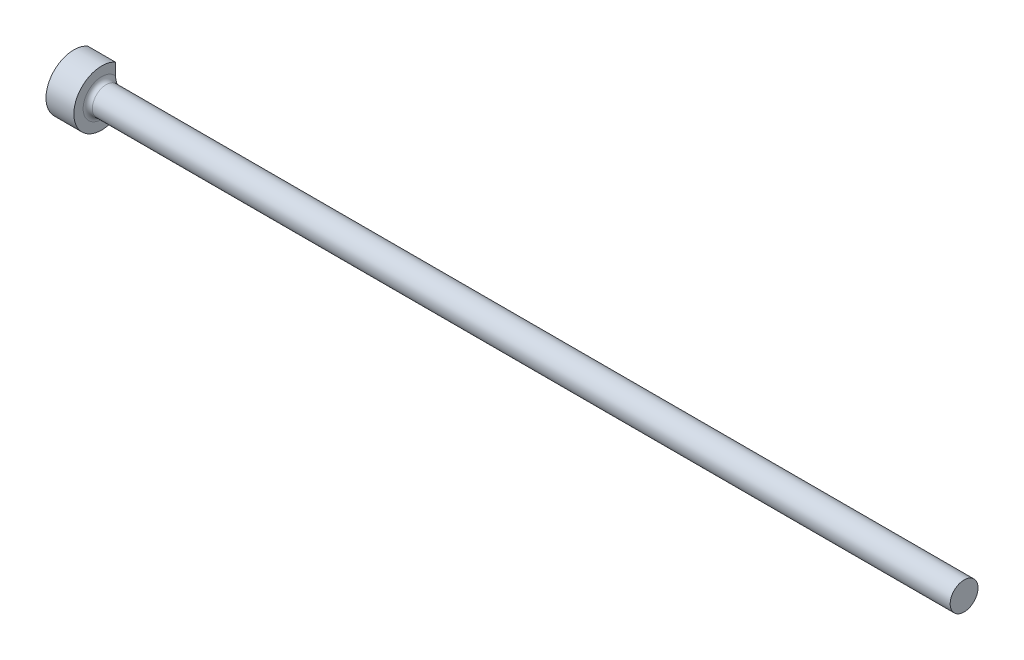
ISO-10303-21;
HEADER;
FILE_DESCRIPTION(('STEP AP214'),'2;1');
FILE_NAME('part.step','',(''),(''),'','','');
FILE_SCHEMA(('AUTOMOTIVE_DESIGN { 1 0 10303 214 1 1 1 1 }'));
ENDSEC;
DATA;
#1=APPLICATION_CONTEXT('core data for automotive mechanical design processes');
#2=APPLICATION_PROTOCOL_DEFINITION('international standard','automotive_design',2000,#1);
#3=PRODUCT_CONTEXT('',#1,'mechanical');
#4=PRODUCT('Part','Part','',(#3));
#5=PRODUCT_RELATED_PRODUCT_CATEGORY('part','',(#4));
#6=PRODUCT_DEFINITION_FORMATION('','',#4);
#7=PRODUCT_DEFINITION_CONTEXT('part definition',#1,'design');
#8=PRODUCT_DEFINITION('design','',#6,#7);
#9=PRODUCT_DEFINITION_SHAPE('','',#8);
#10=(LENGTH_UNIT() NAMED_UNIT(*) SI_UNIT(.MILLI.,.METRE.));
#11=(NAMED_UNIT(*) PLANE_ANGLE_UNIT() SI_UNIT($,.RADIAN.));
#12=(NAMED_UNIT(*) SI_UNIT($,.STERADIAN.) SOLID_ANGLE_UNIT());
#13=UNCERTAINTY_MEASURE_WITH_UNIT(LENGTH_MEASURE(1.E-05),#10,'distance_accuracy_value','');
#14=(GEOMETRIC_REPRESENTATION_CONTEXT(3) GLOBAL_UNCERTAINTY_ASSIGNED_CONTEXT((#13)) GLOBAL_UNIT_ASSIGNED_CONTEXT((#10,
#11,#12)) REPRESENTATION_CONTEXT('',''));
#15=CARTESIAN_POINT('',(0.,0.,0.));
#16=DIRECTION('',(0.,0.,1.));
#17=DIRECTION('',(1.,0.,0.));
#18=AXIS2_PLACEMENT_3D('',#15,#16,#17);
#19=CARTESIAN_POINT('',(0.,0.,0.));
#20=DIRECTION('',(1.,0.,0.));
#21=DIRECTION('',(0.,1.,0.));
#22=AXIS2_PLACEMENT_3D('',#19,#20,#21);
#23=PLANE('',#22);
#24=DIRECTION('',(0.,1.,0.));
#25=VECTOR('',#24,1.);
#26=CARTESIAN_POINT('',(0.,0.,-2.38150400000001));
#27=LINE('',#26,#25);
#28=CARTESIAN_POINT('',(0.,-4.12429932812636,-2.38150400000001));
#29=VERTEX_POINT('',#28);
#30=CARTESIAN_POINT('',(0.,4.12429932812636,-2.38150400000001));
#31=VERTEX_POINT('',#30);
#32=EDGE_CURVE('E49',#29,#31,#27,.T.);
#33=ORIENTED_EDGE('',*,*,#32,.F.);
#34=CARTESIAN_POINT('',(0.,0.,0.));
#35=DIRECTION('',(-1.,0.,0.));
#36=DIRECTION('',(0.,-1.,0.));
#37=AXIS2_PLACEMENT_3D('',#34,#35,#36);
#38=CIRCLE('',#37,4.76249999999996);
#39=EDGE_CURVE('E43',#29,#31,#38,.T.);
#40=ORIENTED_EDGE('',*,*,#39,.T.);
#41=EDGE_LOOP('',(#33,#40));
#42=FACE_BOUND('',#41,.T.);
#43=ADVANCED_FACE('F32',(#42),#23,.F.);
#44=CARTESIAN_POINT('',(152.4,0.,0.));
#45=DIRECTION('',(-1.,0.,0.));
#46=DIRECTION('',(0.,-1.,0.));
#47=AXIS2_PLACEMENT_3D('',#44,#45,#46);
#48=CYLINDRICAL_SURFACE('',#47,4.76249999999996);
#49=DIRECTION('',(-1.,0.,0.));
#50=VECTOR('',#49,1.);
#51=CARTESIAN_POINT('',(152.4,-4.12429932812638,-2.38150400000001));
#52=LINE('',#51,#50);
#53=CARTESIAN_POINT('',(4.7625,-4.12429932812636,-2.38150400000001));
#54=VERTEX_POINT('',#53);
#55=EDGE_CURVE('E87',#54,#29,#52,.T.);
#56=ORIENTED_EDGE('',*,*,#55,.F.);
#57=CARTESIAN_POINT('',(4.7625,0.,0.));
#58=DIRECTION('',(-1.,0.,0.));
#59=DIRECTION('',(0.,-1.,0.));
#60=AXIS2_PLACEMENT_3D('',#57,#58,#59);
#61=CIRCLE('',#60,4.76249999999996);
#62=CARTESIAN_POINT('',(4.7625,4.12429932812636,-2.38150400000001));
#63=VERTEX_POINT('',#62);
#64=EDGE_CURVE('E75',#54,#63,#61,.T.);
#65=ORIENTED_EDGE('',*,*,#64,.T.);
#66=DIRECTION('',(-1.,0.,0.));
#67=VECTOR('',#66,1.);
#68=CARTESIAN_POINT('',(152.4,4.12429932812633,-2.38150400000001));
#69=LINE('',#68,#67);
#70=EDGE_CURVE('E56',#31,#63,#69,.F.);
#71=ORIENTED_EDGE('',*,*,#70,.F.);
#72=ORIENTED_EDGE('',*,*,#39,.F.);
#73=EDGE_LOOP('',(#56,#65,#71,#72));
#74=FACE_BOUND('',#73,.T.);
#75=ADVANCED_FACE('F97',(#74),#48,.T.);
#76=CARTESIAN_POINT('',(4.7625,4.76249999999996,0.));
#77=DIRECTION('',(-1.,0.,0.));
#78=DIRECTION('',(0.,-1.,0.));
#79=AXIS2_PLACEMENT_3D('',#76,#77,#78);
#80=PLANE('',#79);
#81=DIRECTION('',(0.,-1.,0.));
#82=VECTOR('',#81,1.);
#83=CARTESIAN_POINT('',(4.7625,4.76249999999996,-2.38150400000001));
#84=LINE('',#83,#82);
#85=CARTESIAN_POINT('',(4.7625,2.09016303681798,-2.38150400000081));
#86=VERTEX_POINT('',#85);
#87=EDGE_CURVE('E84',#63,#86,#84,.T.);
#88=ORIENTED_EDGE('',*,*,#87,.F.);
#89=ORIENTED_EDGE('',*,*,#64,.F.);
#90=CARTESIAN_POINT('',(4.7625,-2.09016303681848,-2.38150400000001));
#91=VERTEX_POINT('',#90);
#92=EDGE_CURVE('E80',#91,#54,#84,.T.);
#93=ORIENTED_EDGE('',*,*,#92,.F.);
#94=CARTESIAN_POINT('',(4.7625,0.,0.));
#95=DIRECTION('',(-1.,0.,0.));
#96=DIRECTION('',(0.,-1.,0.));
#97=AXIS2_PLACEMENT_3D('',#94,#95,#96);
#98=CIRCLE('',#97,3.16865);
#99=EDGE_CURVE('E70',#91,#86,#98,.T.);
#100=ORIENTED_EDGE('',*,*,#99,.T.);
#101=EDGE_LOOP('',(#88,#89,#93,#100));
#102=FACE_BOUND('',#101,.T.);
#103=ADVANCED_FACE('F81',(#102),#80,.F.);
#104=CARTESIAN_POINT('',(5.5499,0.,0.));
#105=DIRECTION('',(-1.,0.,0.));
#106=DIRECTION('',(0.,-1.,0.));
#107=AXIS2_PLACEMENT_3D('',#104,#105,#106);
#108=TOROIDAL_SURFACE('',#107,3.16865,0.787399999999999);
#109=CARTESIAN_POINT('',(5.5499,0.,0.));
#110=DIRECTION('',(-1.,0.,0.));
#111=DIRECTION('',(0.,-1.,0.));
#112=AXIS2_PLACEMENT_3D('',#109,#110,#111);
#113=CIRCLE('',#112,2.38125);
#114=CARTESIAN_POINT('',(5.5499,-2.38125,0.));
#115=VERTEX_POINT('',#114);
#116=EDGE_CURVE('E76',#115,#115,#113,.T.);
#117=ORIENTED_EDGE('',*,*,#116,.T.);
#118=EDGE_LOOP('',(#117));
#119=FACE_BOUND('',#118,.T.);
#120=CARTESIAN_POINT('',(5.52990163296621,0.,-2.38150400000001));
#121=CARTESIAN_POINT('',(5.52989322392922,-0.00612063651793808,-2.38150400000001));
#122=CARTESIAN_POINT('',(5.52890240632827,-0.0122427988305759,-2.38150400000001));
#123=CARTESIAN_POINT('',(5.52573986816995,-0.0242237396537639,-2.38150400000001));
#124=CARTESIAN_POINT('',(5.52354525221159,-0.0300749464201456,-2.38150400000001));
#125=CARTESIAN_POINT('',(5.51205911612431,-0.0581616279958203,-2.38150400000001));
#126=CARTESIAN_POINT('',(5.50043530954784,-0.0793524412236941,-2.38150400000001));
#127=CARTESIAN_POINT('',(5.47727250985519,-0.121477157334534,-2.38150400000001));
#128=CARTESIAN_POINT('',(5.46573351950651,-0.142411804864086,-2.38150400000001));
#129=CARTESIAN_POINT('',(5.43096697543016,-0.204982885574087,-2.38150400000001));
#130=CARTESIAN_POINT('',(5.40751653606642,-0.246522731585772,-2.38150400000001));
#131=CARTESIAN_POINT('',(5.3609622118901,-0.3297912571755,-2.38150400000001));
#132=CARTESIAN_POINT('',(5.33785842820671,-0.371519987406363,-2.38150400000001));
#133=CARTESIAN_POINT('',(5.29197775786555,-0.455417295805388,-2.38150400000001));
#134=CARTESIAN_POINT('',(5.26920287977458,-0.497587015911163,-2.38150400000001));
#135=CARTESIAN_POINT('',(5.22431538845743,-0.582264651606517,-2.38150400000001));
#136=CARTESIAN_POINT('',(5.2022027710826,-0.624772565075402,-2.38150400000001));
#137=CARTESIAN_POINT('',(5.09259709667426,-0.840505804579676,-2.38150400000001));
#138=CARTESIAN_POINT('',(5.01126780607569,-1.01722711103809,-2.38150400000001));
#139=CARTESIAN_POINT('',(4.90984993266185,-1.28951258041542,-2.38150400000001));
#140=CARTESIAN_POINT('',(4.87952695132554,-1.38122131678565,-2.38150400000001));
#141=CARTESIAN_POINT('',(4.82784510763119,-1.56709229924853,-2.38150400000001));
#142=CARTESIAN_POINT('',(4.80647377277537,-1.66125093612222,-2.38150400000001));
#143=CARTESIAN_POINT('',(4.77935745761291,-1.82676032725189,-2.38150400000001));
#144=CARTESIAN_POINT('',(4.77099421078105,-1.89767533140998,-2.38150400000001));
#145=CARTESIAN_POINT('',(4.76188007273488,-2.04013238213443,-2.38150400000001));
#146=CARTESIAN_POINT('',(4.76113842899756,-2.11167508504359,-2.38150400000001));
#147=CARTESIAN_POINT('',(4.76877745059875,-2.25484218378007,-2.38150400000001));
#148=CARTESIAN_POINT('',(4.77722304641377,-2.32646354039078,-2.38150400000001));
#149=CARTESIAN_POINT('',(4.80498534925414,-2.46760262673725,-2.38150400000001));
#150=CARTESIAN_POINT('',(4.82428631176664,-2.53712324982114,-2.38150400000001));
#151=CARTESIAN_POINT('',(4.86858706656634,-2.65375446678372,-2.38150400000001));
#152=CARTESIAN_POINT('',(4.890742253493,-2.70194056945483,-2.38150400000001));
#153=CARTESIAN_POINT('',(4.94229794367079,-2.79429222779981,-2.38150400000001));
#154=CARTESIAN_POINT('',(4.97169001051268,-2.83846238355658,-2.38150400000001));
#155=CARTESIAN_POINT('',(5.03213850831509,-2.9137187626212,-2.38150400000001));
#156=CARTESIAN_POINT('',(5.06201943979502,-2.94574505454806,-2.38150400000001));
#157=CARTESIAN_POINT('',(5.12666510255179,-3.00447641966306,-2.38150400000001));
#158=CARTESIAN_POINT('',(5.16142863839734,-3.03118279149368,-2.38150400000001));
#159=CARTESIAN_POINT('',(5.23554513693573,-3.07807562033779,-2.38150400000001));
#160=CARTESIAN_POINT('',(5.2749327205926,-3.09820798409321,-2.38150400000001));
#161=CARTESIAN_POINT('',(5.3569100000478,-3.13031515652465,-2.38150400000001));
#162=CARTESIAN_POINT('',(5.39949667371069,-3.14229755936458,-2.38150400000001));
#163=CARTESIAN_POINT('',(5.48015870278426,-3.1561794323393,-2.38150400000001));
#164=CARTESIAN_POINT('',(5.5180348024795,-3.15925214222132,-2.38150400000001));
#165=CARTESIAN_POINT('',(5.59371392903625,-3.15852942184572,-2.38150400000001));
#166=CARTESIAN_POINT('',(5.63151697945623,-3.15473680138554,-2.38150400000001));
#167=CARTESIAN_POINT('',(5.70351231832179,-3.14096403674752,-2.38150400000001));
#168=CARTESIAN_POINT('',(5.73778271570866,-3.1313848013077,-2.38150400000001));
#169=CARTESIAN_POINT('',(5.80434255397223,-3.10687747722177,-2.38150400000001));
#170=CARTESIAN_POINT('',(5.83663182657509,-3.091948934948,-2.38150400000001));
#171=CARTESIAN_POINT('',(5.9001390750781,-3.05652627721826,-2.38150400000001));
#172=CARTESIAN_POINT('',(5.93122087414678,-3.03578942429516,-2.38150400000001));
#173=CARTESIAN_POINT('',(5.9899970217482,-2.98999002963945,-2.38150400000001));
#174=CARTESIAN_POINT('',(6.01769006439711,-2.96492582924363,-2.38150400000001));
#175=CARTESIAN_POINT('',(6.07304487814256,-2.9075801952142,-2.38150400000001));
#176=CARTESIAN_POINT('',(6.10016730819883,-2.87477983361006,-2.38150400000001));
#177=CARTESIAN_POINT('',(6.14964006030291,-2.80577639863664,-2.38150400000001));
#178=CARTESIAN_POINT('',(6.17198708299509,-2.7695709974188,-2.38150400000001));
#179=CARTESIAN_POINT('',(6.22313633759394,-2.67395654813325,-2.38150400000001));
#180=CARTESIAN_POINT('',(6.24867122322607,-2.61279073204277,-2.38150400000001));
#181=CARTESIAN_POINT('',(6.2896002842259,-2.48715900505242,-2.38150400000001));
#182=CARTESIAN_POINT('',(6.3049715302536,-2.42268598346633,-2.38150400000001));
#183=CARTESIAN_POINT('',(6.3317161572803,-2.26298997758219,-2.38150400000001));
#184=CARTESIAN_POINT('',(6.33819597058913,-2.16695757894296,-2.38150400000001));
#185=CARTESIAN_POINT('',(6.3362031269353,-1.97513528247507,-2.38150400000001));
#186=CARTESIAN_POINT('',(6.32770585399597,-1.87934604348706,-2.38150400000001));
#187=CARTESIAN_POINT('',(6.30101314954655,-1.70306032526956,-2.38150400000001));
#188=CARTESIAN_POINT('',(6.28435815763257,-1.62231590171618,-2.38150400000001));
#189=CARTESIAN_POINT('',(6.24408121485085,-1.46255668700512,-2.38150400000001));
#190=CARTESIAN_POINT('',(6.22045358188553,-1.38354336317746,-2.38150400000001));
#191=CARTESIAN_POINT('',(6.14126457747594,-1.1491323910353,-2.38150400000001));
#192=CARTESIAN_POINT('',(6.07743226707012,-0.996550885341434,-2.38150400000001));
#193=CARTESIAN_POINT('',(5.97284106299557,-0.773894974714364,-2.38150400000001));
#194=CARTESIAN_POINT('',(5.93689166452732,-0.70138345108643,-2.38150400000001));
#195=CARTESIAN_POINT('',(5.86283160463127,-0.557602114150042,-2.38150400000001));
#196=CARTESIAN_POINT('',(5.82472449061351,-0.486330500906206,-2.38150400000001));
#197=CARTESIAN_POINT('',(5.76828938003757,-0.383124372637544,-2.38150400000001));
#198=CARTESIAN_POINT('',(5.75048624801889,-0.350895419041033,-2.38150400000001));
#199=CARTESIAN_POINT('',(5.71467671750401,-0.286514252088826,-2.38150400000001));
#200=CARTESIAN_POINT('',(5.69667016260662,-0.254362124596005,-2.38150400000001));
#201=CARTESIAN_POINT('',(5.66657012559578,-0.200640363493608,-2.38150400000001));
#202=CARTESIAN_POINT('',(5.65447967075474,-0.179068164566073,-2.38150400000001));
#203=CARTESIAN_POINT('',(5.63038805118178,-0.13592232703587,-2.38150400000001));
#204=CARTESIAN_POINT('',(5.61838675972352,-0.114348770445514,-2.38150400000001));
#205=CARTESIAN_POINT('',(5.6013575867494,-0.082572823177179,-2.38150400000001));
#206=CARTESIAN_POINT('',(5.59605901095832,-0.072511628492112,-2.38150400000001));
#207=CARTESIAN_POINT('',(5.58577850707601,-0.0521191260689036,-2.38150400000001));
#208=CARTESIAN_POINT('',(5.58079905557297,-0.041786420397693,-2.38150400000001));
#209=CARTESIAN_POINT('',(5.57479482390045,-0.026038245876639,-2.38150400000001));
#210=CARTESIAN_POINT('',(5.57307270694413,-0.0209186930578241,-2.38150400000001));
#211=CARTESIAN_POINT('',(5.5712281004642,-0.0131039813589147,-2.38150400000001));
#212=CARTESIAN_POINT('',(5.57073756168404,-0.0105010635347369,-2.38150400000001));
#213=CARTESIAN_POINT('',(5.5700722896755,-0.00525652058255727,-2.38150400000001));
#214=CARTESIAN_POINT('',(5.56989711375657,-0.00261495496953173,-2.38150400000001));
#215=CARTESIAN_POINT('',(5.56989964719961,0.00270001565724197,-2.38150400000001));
#216=CARTESIAN_POINT('',(5.57008166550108,0.00537341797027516,-2.38150400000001));
#217=CARTESIAN_POINT('',(5.57076614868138,0.0106804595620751,-2.38150400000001));
#218=CARTESIAN_POINT('',(5.57126907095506,0.0133140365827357,-2.38150400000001));
#219=CARTESIAN_POINT('',(5.57316340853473,0.0212234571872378,-2.38150400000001));
#220=CARTESIAN_POINT('',(5.57493506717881,0.0264018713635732,-2.38150400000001));
#221=CARTESIAN_POINT('',(5.58383050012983,0.0497364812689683,-2.38150400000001));
#222=CARTESIAN_POINT('',(5.59299757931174,0.0670063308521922,-2.38150400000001));
#223=CARTESIAN_POINT('',(5.61143614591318,0.101278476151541,-2.38150400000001));
#224=CARTESIAN_POINT('',(5.62070674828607,0.118281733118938,-2.38150400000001));
#225=CARTESIAN_POINT('',(5.64868756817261,0.169014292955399,-2.38150400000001));
#226=CARTESIAN_POINT('',(5.66765092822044,0.20262616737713,-2.38150400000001));
#227=CARTESIAN_POINT('',(5.7054298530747,0.269933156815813,-2.38150400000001));
#228=CARTESIAN_POINT('',(5.72424536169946,0.303628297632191,-2.38150400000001));
#229=CARTESIAN_POINT('',(5.78047554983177,0.405074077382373,-2.38150400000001));
#230=CARTESIAN_POINT('',(5.81756848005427,0.473000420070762,-2.38150400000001));
#231=CARTESIAN_POINT('',(5.94100715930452,0.705891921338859,-2.38150400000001));
#232=CARTESIAN_POINT('',(6.02335722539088,0.873153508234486,-2.38150400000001));
#233=CARTESIAN_POINT('',(6.1310291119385,1.13048043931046,-2.38150400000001));
#234=CARTESIAN_POINT('',(6.16424029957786,1.2171963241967,-2.38150400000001));
#235=CARTESIAN_POINT('',(6.22365513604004,1.39296826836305,-2.38150400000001));
#236=CARTESIAN_POINT('',(6.24986459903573,1.48202231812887,-2.38150400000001));
#237=CARTESIAN_POINT('',(6.29330543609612,1.6626619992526,-2.38150400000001));
#238=CARTESIAN_POINT('',(6.31050770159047,1.75425484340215,-2.38150400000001));
#239=CARTESIAN_POINT('',(6.33325202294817,1.93904703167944,-2.38150400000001));
#240=CARTESIAN_POINT('',(6.33879001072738,2.03224692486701,-2.38150400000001));
#241=CARTESIAN_POINT('',(6.3354302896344,2.20267124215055,-2.38150400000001));
#242=CARTESIAN_POINT('',(6.32881763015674,2.27992919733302,-2.38150400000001));
#243=CARTESIAN_POINT('',(6.30339781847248,2.4324442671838,-2.38150400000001));
#244=CARTESIAN_POINT('',(6.28461416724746,2.5077049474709,-2.38150400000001));
#245=CARTESIAN_POINT('',(6.24060362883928,2.63155014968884,-2.38150400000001));
#246=CARTESIAN_POINT('',(6.21896108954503,2.6814046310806,-2.38150400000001));
#247=CARTESIAN_POINT('',(6.16812370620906,2.77712862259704,-2.38150400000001));
#248=CARTESIAN_POINT('',(6.13893817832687,2.82300295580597,-2.38150400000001));
#249=CARTESIAN_POINT('',(6.07891268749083,2.90082244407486,-2.38150400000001));
#250=CARTESIAN_POINT('',(6.04938196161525,2.93377339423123,-2.38150400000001));
#251=CARTESIAN_POINT('',(5.98529188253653,2.99441653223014,-2.38150400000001));
#252=CARTESIAN_POINT('',(5.95073373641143,3.02210997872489,-2.38150400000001));
#253=CARTESIAN_POINT('',(5.87683609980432,3.07101393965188,-2.38150400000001));
#254=CARTESIAN_POINT('',(5.83745931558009,3.09216875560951,-2.38150400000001));
#255=CARTESIAN_POINT('',(5.75529142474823,3.12627116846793,-2.38150400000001));
#256=CARTESIAN_POINT('',(5.71250371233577,3.13922681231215,-2.38150400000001));
#257=CARTESIAN_POINT('',(5.63141142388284,3.15477165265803,-2.38150400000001));
#258=CARTESIAN_POINT('',(5.59333697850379,3.15857509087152,-2.38150400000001));
#259=CARTESIAN_POINT('',(5.51713653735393,3.15921794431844,-2.38150400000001));
#260=CARTESIAN_POINT('',(5.47901057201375,3.15606045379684,-2.38150400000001));
#261=CARTESIAN_POINT('',(5.40653309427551,3.14343250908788,-2.38150400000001));
#262=CARTESIAN_POINT('',(5.37210200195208,3.13440965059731,-2.38150400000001));
#263=CARTESIAN_POINT('',(5.30514560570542,3.11095570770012,-2.38150400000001));
#264=CARTESIAN_POINT('',(5.27262042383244,3.09652427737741,-2.38150400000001));
#265=CARTESIAN_POINT('',(5.20873111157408,3.06213080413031,-2.38150400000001));
#266=CARTESIAN_POINT('',(5.1774870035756,3.0419471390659,-2.38150400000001));
#267=CARTESIAN_POINT('',(5.11832006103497,2.9972091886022,-2.38150400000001));
#268=CARTESIAN_POINT('',(5.09039846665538,2.97265327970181,-2.38150400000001));
#269=CARTESIAN_POINT('',(5.03460457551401,2.91644125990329,-2.38150400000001));
#270=CARTESIAN_POINT('',(5.00724886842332,2.88427408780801,-2.38150400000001));
#271=CARTESIAN_POINT('',(4.95723885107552,2.81648956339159,-2.38150400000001));
#272=CARTESIAN_POINT('',(4.93458778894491,2.78086985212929,-2.38150400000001));
#273=CARTESIAN_POINT('',(4.88275784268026,2.68697769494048,-2.38150400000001));
#274=CARTESIAN_POINT('',(4.85675406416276,2.62694376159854,-2.38150400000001));
#275=CARTESIAN_POINT('',(4.81472200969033,2.50348504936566,-2.38150400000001));
#276=CARTESIAN_POINT('',(4.79871590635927,2.4400530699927,-2.38150400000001));
#277=CARTESIAN_POINT('',(4.77035214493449,2.28318495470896,-2.38150400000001));
#278=CARTESIAN_POINT('',(4.76274682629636,2.18889794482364,-2.38150400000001));
#279=CARTESIAN_POINT('',(4.76226424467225,2.00037848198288,-2.38150400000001));
#280=CARTESIAN_POINT('',(4.76941201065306,1.90614639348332,-2.38150400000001));
#281=CARTESIAN_POINT('',(4.80434476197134,1.65412862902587,-2.38150400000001));
#282=CARTESIAN_POINT('',(4.84305502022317,1.49791139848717,-2.38150400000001));
#283=CARTESIAN_POINT('',(4.94199374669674,1.19274043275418,-2.38150400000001));
#284=CARTESIAN_POINT('',(5.00226996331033,1.04380365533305,-2.38150400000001));
#285=CARTESIAN_POINT('',(5.1040153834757,0.821405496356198,-2.38150400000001));
#286=CARTESIAN_POINT('',(5.14080412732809,0.745721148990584,-2.38150400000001));
#287=CARTESIAN_POINT('',(5.21691136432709,0.595726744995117,-2.38150400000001));
#288=CARTESIAN_POINT('',(5.25622742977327,0.521415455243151,-2.38150400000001));
#289=CARTESIAN_POINT('',(5.32421250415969,0.396228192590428,-2.38150400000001));
#290=CARTESIAN_POINT('',(5.35246730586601,0.345124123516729,-2.38150400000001));
#291=CARTESIAN_POINT('',(5.3951079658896,0.268665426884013,-2.38150400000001));
#292=CARTESIAN_POINT('',(5.40935356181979,0.243231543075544,-2.38150400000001));
#293=CARTESIAN_POINT('',(5.4378824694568,0.192362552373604,-2.38150400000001));
#294=CARTESIAN_POINT('',(5.45216579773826,0.166927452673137,-2.38150400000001));
#295=CARTESIAN_POINT('',(5.47483470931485,0.126053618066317,-2.38150400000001));
#296=CARTESIAN_POINT('',(5.4833082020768,0.110659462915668,-2.38150400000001));
#297=CARTESIAN_POINT('',(5.50002784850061,0.0797494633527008,-2.38150400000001));
#298=CARTESIAN_POINT('',(5.50827429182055,0.0642338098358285,-2.38150400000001));
#299=CARTESIAN_POINT('',(5.51844280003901,0.0423691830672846,-2.38150400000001));
#300=CARTESIAN_POINT('',(5.52109329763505,0.0363596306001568,-2.38150400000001));
#301=CARTESIAN_POINT('',(5.52572154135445,0.0240923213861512,-2.38150400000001));
#302=CARTESIAN_POINT('',(5.52770443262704,0.0178368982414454,-2.38150400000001));
#303=CARTESIAN_POINT('',(5.52918854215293,0.00953449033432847,-2.38150400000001));
#304=CARTESIAN_POINT('',(5.52945349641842,0.0076339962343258,-2.38150400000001));
#305=CARTESIAN_POINT('',(5.52981109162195,0.00382235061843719,-2.38150400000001));
#306=CARTESIAN_POINT('',(5.52990425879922,0.00191124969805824,-2.38150400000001));
#307=CARTESIAN_POINT('',(5.52990163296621,0.,-2.38150400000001));
#308=B_SPLINE_CURVE_WITH_KNOTS('',3,(#120,#121,#122,#123,#124,#125,#126,#127,#128,#129,#130,
#131,#132,#133,#134,#135,#136,#137,#138,#139,#140,#141,#142,#143,#144,#145,#146,#147,#148,#149,
#150,#151,#152,#153,#154,#155,#156,#157,#158,#159,#160,#161,#162,#163,#164,#165,#166,#167,#168,
#169,#170,#171,#172,#173,#174,#175,#176,#177,#178,#179,#180,#181,#182,#183,#184,#185,#186,#187,
#188,#189,#190,#191,#192,#193,#194,#195,#196,#197,#198,#199,#200,#201,#202,#203,#204,#205,#206,
#207,#208,#209,#210,#211,#212,#213,#214,#215,#216,#217,#218,#219,#220,#221,#222,#223,#224,#225,
#226,#227,#228,#229,#230,#231,#232,#233,#234,#235,#236,#237,#238,#239,#240,#241,#242,#243,#244,
#245,#246,#247,#248,#249,#250,#251,#252,#253,#254,#255,#256,#257,#258,#259,#260,#261,#262,#263,
#264,#265,#266,#267,#268,#269,#270,#271,#272,#273,#274,#275,#276,#277,#278,#279,#280,#281,#282,
#283,#284,#285,#286,#287,#288,#289,#290,#291,#292,#293,#294,#295,#296,#297,#298,#299,#300,#301,
#302,#303,#304,#305,#306,#307),.UNSPECIFIED.,.T.,.F.,(4,2,2,2,2,2,2,2,2,2,2,2,2,2,2,2,2,2,2,2,2,
2,2,2,2,2,2,2,2,2,2,2,2,2,2,2,2,2,2,2,2,2,2,2,2,2,2,2,2,2,2,2,2,2,2,2,2,2,2,2,2,2,2,2,2,2,2,2,2,
2,2,2,2,2,2,2,2,2,2,2,2,2,2,2,2,2,2,2,2,2,2,2,2,4),(0.,0.0183549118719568,0.0370716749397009,
0.109365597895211,0.181129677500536,0.324192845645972,0.467296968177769,0.611063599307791,
0.754829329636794,1.33681456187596,1.62626982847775,1.91532043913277,2.12921042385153,
2.34335989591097,2.55903275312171,2.77439360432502,2.93296814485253,3.09135869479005,
3.22224226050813,3.35309383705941,3.48499645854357,3.616776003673,3.73017521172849,
3.84352801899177,3.94980693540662,4.05609486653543,4.16774372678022,4.27943547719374,
4.40665147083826,4.53395507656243,4.73167957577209,4.92984863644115,5.21699190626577,
5.50460755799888,5.75157275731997,5.99873977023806,6.49363910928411,6.73644436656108,
6.97886141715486,7.08932048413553,7.19987120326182,7.27406227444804,7.34811114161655,
7.38223095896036,7.41658965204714,7.43274054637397,7.44067133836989,7.44859098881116,
7.45660676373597,7.46463398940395,7.48100077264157,7.53947374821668,7.59761564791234,
7.71335686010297,7.82914011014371,8.06134442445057,8.6196839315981,8.89803646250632,
9.17615712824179,9.45517113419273,9.73428243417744,9.96614422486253,10.1975596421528,
10.3600631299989,10.5223668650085,10.6545885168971,10.7867784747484,10.9200652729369,
11.0532210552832,11.1674000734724,11.2815283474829,11.3878330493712,11.4941445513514,
11.6052895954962,11.7164759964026,11.8426881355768,11.9689871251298,12.1641526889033,
12.3597495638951,12.6419398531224,12.9246092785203,13.404659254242,13.8857787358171,
14.1381917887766,14.3903659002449,14.5655478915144,14.6530047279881,14.7405102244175,
14.7932388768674,14.8458968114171,14.8656034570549,14.8851545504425,14.8909037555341,
14.8966353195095),.UNSPECIFIED.);
#309=EDGE_CURVE('E12',#86,#91,#308,.T.);
#310=ORIENTED_EDGE('',*,*,#309,.F.);
#311=ORIENTED_EDGE('',*,*,#99,.F.);
#312=EDGE_LOOP('',(#310,#311));
#313=FACE_BOUND('',#312,.T.);
#314=ADVANCED_FACE('F72',(#119,#313),#108,.F.);
#315=CARTESIAN_POINT('',(152.4,0.,0.));
#316=DIRECTION('',(-1.,0.,0.));
#317=DIRECTION('',(0.,-1.,0.));
#318=AXIS2_PLACEMENT_3D('',#315,#316,#317);
#319=CYLINDRICAL_SURFACE('',#318,2.38125000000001);
#320=ORIENTED_EDGE('',*,*,#116,.F.);
#321=EDGE_LOOP('',(#320));
#322=FACE_BOUND('',#321,.T.);
#323=CARTESIAN_POINT('',(152.4,0.,0.));
#324=DIRECTION('',(-1.,0.,0.));
#325=DIRECTION('',(0.,-1.,0.));
#326=AXIS2_PLACEMENT_3D('',#323,#324,#325);
#327=CIRCLE('',#326,2.38125000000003);
#328=CARTESIAN_POINT('',(152.4,-2.38125000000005,0.));
#329=VERTEX_POINT('',#328);
#330=EDGE_CURVE('E92',#329,#329,#327,.T.);
#331=ORIENTED_EDGE('',*,*,#330,.T.);
#332=EDGE_LOOP('',(#331));
#333=FACE_BOUND('',#332,.T.);
#334=ADVANCED_FACE('F107',(#322,#333),#319,.T.);
#335=CARTESIAN_POINT('',(152.4,2.38125,0.));
#336=DIRECTION('',(-1.,0.,0.));
#337=DIRECTION('',(0.,-1.,0.));
#338=AXIS2_PLACEMENT_3D('',#335,#336,#337);
#339=PLANE('',#338);
#340=ORIENTED_EDGE('',*,*,#330,.F.);
#341=EDGE_LOOP('',(#340));
#342=FACE_BOUND('',#341,.T.);
#343=ADVANCED_FACE('F111',(#342),#339,.F.);
#344=CARTESIAN_POINT('',(0.,0.,-2.38150400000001));
#345=DIRECTION('',(0.,0.,-1.));
#346=DIRECTION('',(0.,1.,0.));
#347=AXIS2_PLACEMENT_3D('',#344,#345,#346);
#348=PLANE('',#347);
#349=ORIENTED_EDGE('',*,*,#55,.T.);
#350=ORIENTED_EDGE('',*,*,#32,.T.);
#351=ORIENTED_EDGE('',*,*,#70,.T.);
#352=ORIENTED_EDGE('',*,*,#87,.T.);
#353=ORIENTED_EDGE('',*,*,#309,.T.);
#354=ORIENTED_EDGE('',*,*,#92,.T.);
#355=EDGE_LOOP('',(#349,#350,#351,#352,#353,#354));
#356=FACE_BOUND('',#355,.T.);
#357=ADVANCED_FACE('F86',(#356),#348,.T.);
#358=CLOSED_SHELL('',(#43,#75,#103,#314,#334,#343,#357));
#359=MANIFOLD_SOLID_BREP('B2',#358);
#360=ADVANCED_BREP_SHAPE_REPRESENTATION('',(#18,#359),#14);
#361=SHAPE_DEFINITION_REPRESENTATION(#9,#360);
ENDSEC;
END-ISO-10303-21;
